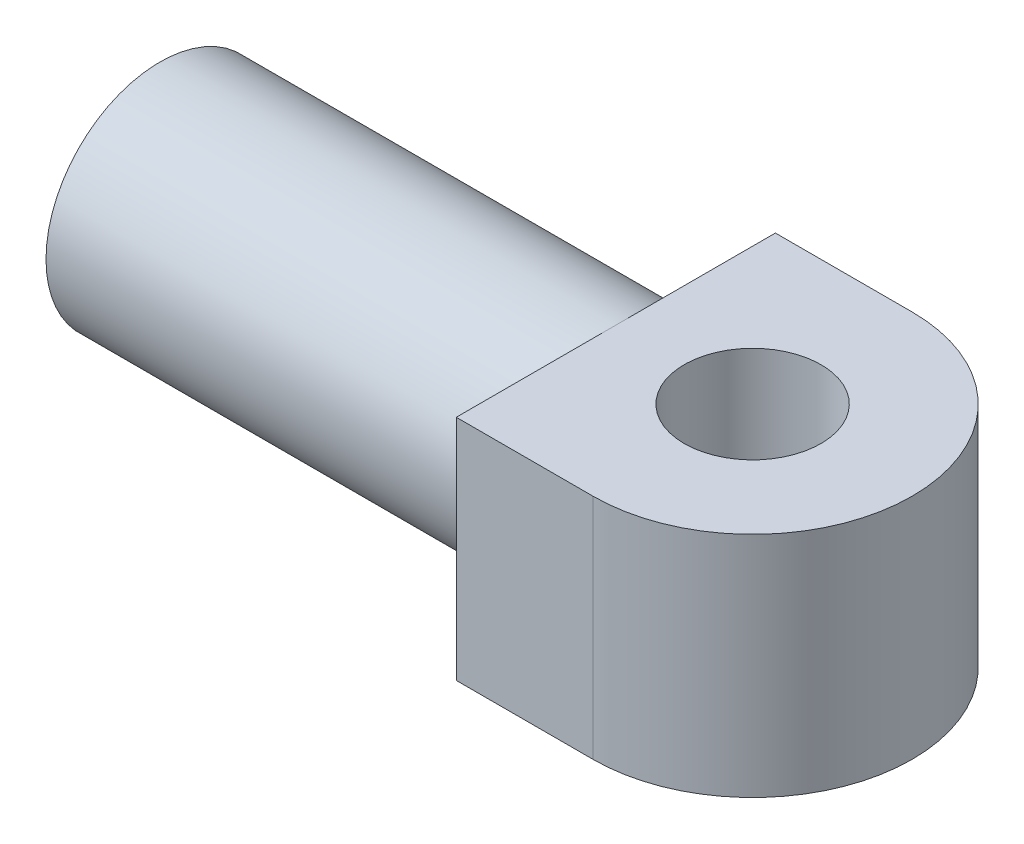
ISO-10303-21;
HEADER;
FILE_DESCRIPTION(('STEP AP214'),'2;1');
FILE_NAME('part.step','',(''),(''),'','','');
FILE_SCHEMA(('AUTOMOTIVE_DESIGN { 1 0 10303 214 1 1 1 1 }'));
ENDSEC;
DATA;
#1=APPLICATION_CONTEXT('core data for automotive mechanical design processes');
#2=APPLICATION_PROTOCOL_DEFINITION('international standard','automotive_design',2000,#1);
#3=PRODUCT_CONTEXT('',#1,'mechanical');
#4=PRODUCT('Part','Part','',(#3));
#5=PRODUCT_RELATED_PRODUCT_CATEGORY('part','',(#4));
#6=PRODUCT_DEFINITION_FORMATION('','',#4);
#7=PRODUCT_DEFINITION_CONTEXT('part definition',#1,'design');
#8=PRODUCT_DEFINITION('design','',#6,#7);
#9=PRODUCT_DEFINITION_SHAPE('','',#8);
#10=(LENGTH_UNIT() NAMED_UNIT(*) SI_UNIT(.MILLI.,.METRE.));
#11=(NAMED_UNIT(*) PLANE_ANGLE_UNIT() SI_UNIT($,.RADIAN.));
#12=(NAMED_UNIT(*) SI_UNIT($,.STERADIAN.) SOLID_ANGLE_UNIT());
#13=UNCERTAINTY_MEASURE_WITH_UNIT(LENGTH_MEASURE(1.E-05),#10,'distance_accuracy_value','');
#14=(GEOMETRIC_REPRESENTATION_CONTEXT(3) GLOBAL_UNCERTAINTY_ASSIGNED_CONTEXT((#13)) GLOBAL_UNIT_ASSIGNED_CONTEXT((#10,
#11,#12)) REPRESENTATION_CONTEXT('',''));
#15=CARTESIAN_POINT('',(0.,0.,0.));
#16=DIRECTION('',(0.,0.,1.));
#17=DIRECTION('',(1.,0.,0.));
#18=AXIS2_PLACEMENT_3D('',#15,#16,#17);
#19=CARTESIAN_POINT('',(-6.,10.,-7.));
#20=DIRECTION('',(1.,0.,0.));
#21=DIRECTION('',(0.,0.,-1.));
#22=AXIS2_PLACEMENT_3D('',#19,#20,#21);
#23=PLANE('',#22);
#24=CARTESIAN_POINT('',(-6.,5.,0.));
#25=DIRECTION('',(-1.,0.,0.));
#26=DIRECTION('',(0.,0.,1.));
#27=AXIS2_PLACEMENT_3D('',#24,#25,#26);
#28=CIRCLE('',#27,5.);
#29=CARTESIAN_POINT('',(-6.,10.,0.));
#30=VERTEX_POINT('',#29);
#31=CARTESIAN_POINT('',(-6.,0.,0.));
#32=VERTEX_POINT('',#31);
#33=EDGE_CURVE('E41',#30,#32,#28,.T.);
#34=ORIENTED_EDGE('',*,*,#33,.F.);
#35=DIRECTION('',(0.,0.,1.));
#36=VECTOR('',#35,1.);
#37=CARTESIAN_POINT('',(-6.,10.,-7.));
#38=LINE('',#37,#36);
#39=CARTESIAN_POINT('',(-6.,10.,-7.));
#40=VERTEX_POINT('',#39);
#41=EDGE_CURVE('E83',#40,#30,#38,.T.);
#42=ORIENTED_EDGE('',*,*,#41,.F.);
#43=DIRECTION('',(0.,-1.,0.));
#44=VECTOR('',#43,1.);
#45=CARTESIAN_POINT('',(-6.,10.,-7.));
#46=LINE('',#45,#44);
#47=CARTESIAN_POINT('',(-6.,0.,-7.));
#48=VERTEX_POINT('',#47);
#49=EDGE_CURVE('E39',#40,#48,#46,.T.);
#50=ORIENTED_EDGE('',*,*,#49,.T.);
#51=DIRECTION('',(0.,0.,1.));
#52=VECTOR('',#51,1.);
#53=CARTESIAN_POINT('',(-6.,0.,-7.));
#54=LINE('',#53,#52);
#55=EDGE_CURVE('E101',#48,#32,#54,.T.);
#56=ORIENTED_EDGE('',*,*,#55,.T.);
#57=EDGE_LOOP('',(#34,#42,#50,#56));
#58=FACE_BOUND('',#57,.T.);
#59=ADVANCED_FACE('F30',(#58),#23,.F.);
#60=EDGE_CURVE('E11',#32,#30,#28,.T.);
#61=ORIENTED_EDGE('',*,*,#60,.F.);
#62=CARTESIAN_POINT('',(-6.,0.,7.));
#63=VERTEX_POINT('',#62);
#64=EDGE_CURVE('E140',#32,#63,#54,.T.);
#65=ORIENTED_EDGE('',*,*,#64,.T.);
#66=DIRECTION('',(0.,-1.,0.));
#67=VECTOR('',#66,1.);
#68=CARTESIAN_POINT('',(-6.,10.,7.));
#69=LINE('',#68,#67);
#70=CARTESIAN_POINT('',(-6.,10.,7.));
#71=VERTEX_POINT('',#70);
#72=EDGE_CURVE('E97',#71,#63,#69,.T.);
#73=ORIENTED_EDGE('',*,*,#72,.F.);
#74=EDGE_CURVE('E88',#30,#71,#38,.T.);
#75=ORIENTED_EDGE('',*,*,#74,.F.);
#76=EDGE_LOOP('',(#61,#65,#73,#75));
#77=FACE_BOUND('',#76,.T.);
#78=ADVANCED_FACE('F95',(#77),#23,.F.);
#79=CARTESIAN_POINT('',(0.,10.,0.));
#80=DIRECTION('',(0.,1.,0.));
#81=DIRECTION('',(0.,0.,1.));
#82=AXIS2_PLACEMENT_3D('',#79,#80,#81);
#83=PLANE('',#82);
#84=DIRECTION('',(-1.,0.,0.));
#85=VECTOR('',#84,1.);
#86=CARTESIAN_POINT('',(-6.,10.,-7.));
#87=LINE('',#86,#85);
#88=CARTESIAN_POINT('',(0.,10.,-7.));
#89=VERTEX_POINT('',#88);
#90=EDGE_CURVE('E91',#89,#40,#87,.T.);
#91=ORIENTED_EDGE('',*,*,#90,.T.);
#92=ORIENTED_EDGE('',*,*,#41,.T.);
#93=ORIENTED_EDGE('',*,*,#74,.T.);
#94=DIRECTION('',(1.,0.,0.));
#95=VECTOR('',#94,1.);
#96=CARTESIAN_POINT('',(-6.,10.,7.));
#97=LINE('',#96,#95);
#98=CARTESIAN_POINT('',(0.,10.,7.));
#99=VERTEX_POINT('',#98);
#100=EDGE_CURVE('E93',#71,#99,#97,.T.);
#101=ORIENTED_EDGE('',*,*,#100,.T.);
#102=CARTESIAN_POINT('',(0.,10.,0.));
#103=DIRECTION('',(0.,1.,0.));
#104=DIRECTION('',(0.,0.,1.));
#105=AXIS2_PLACEMENT_3D('',#102,#103,#104);
#106=CIRCLE('',#105,7.);
#107=EDGE_CURVE('E55',#99,#89,#106,.T.);
#108=ORIENTED_EDGE('',*,*,#107,.T.);
#109=EDGE_LOOP('',(#91,#92,#93,#101,#108));
#110=FACE_BOUND('',#109,.T.);
#111=CARTESIAN_POINT('',(0.,10.,0.));
#112=DIRECTION('',(0.,1.,0.));
#113=DIRECTION('',(0.,0.,1.));
#114=AXIS2_PLACEMENT_3D('',#111,#112,#113);
#115=CIRCLE('',#114,3.);
#116=CARTESIAN_POINT('',(0.,10.,3.));
#117=VERTEX_POINT('',#116);
#118=EDGE_CURVE('E141',#117,#117,#115,.T.);
#119=ORIENTED_EDGE('',*,*,#118,.F.);
#120=EDGE_LOOP('',(#119));
#121=FACE_BOUND('',#120,.T.);
#122=ADVANCED_FACE('F86',(#110,#121),#83,.T.);
#123=CARTESIAN_POINT('',(0.,0.,0.));
#124=DIRECTION('',(0.,1.,0.));
#125=DIRECTION('',(0.,0.,1.));
#126=AXIS2_PLACEMENT_3D('',#123,#124,#125);
#127=PLANE('',#126);
#128=DIRECTION('',(-1.,0.,0.));
#129=VECTOR('',#128,1.);
#130=CARTESIAN_POINT('',(-6.,0.,-7.));
#131=LINE('',#130,#129);
#132=CARTESIAN_POINT('',(0.,0.,-7.));
#133=VERTEX_POINT('',#132);
#134=EDGE_CURVE('E138',#133,#48,#131,.T.);
#135=ORIENTED_EDGE('',*,*,#134,.F.);
#136=CARTESIAN_POINT('',(0.,0.,0.));
#137=DIRECTION('',(0.,1.,0.));
#138=DIRECTION('',(0.,0.,1.));
#139=AXIS2_PLACEMENT_3D('',#136,#137,#138);
#140=CIRCLE('',#139,7.);
#141=CARTESIAN_POINT('',(0.,0.,7.));
#142=VERTEX_POINT('',#141);
#143=EDGE_CURVE('E75',#142,#133,#140,.T.);
#144=ORIENTED_EDGE('',*,*,#143,.F.);
#145=DIRECTION('',(1.,0.,0.));
#146=VECTOR('',#145,1.);
#147=CARTESIAN_POINT('',(-6.,0.,7.));
#148=LINE('',#147,#146);
#149=EDGE_CURVE('E150',#63,#142,#148,.T.);
#150=ORIENTED_EDGE('',*,*,#149,.F.);
#151=ORIENTED_EDGE('',*,*,#64,.F.);
#152=ORIENTED_EDGE('',*,*,#55,.F.);
#153=EDGE_LOOP('',(#135,#144,#150,#151,#152));
#154=FACE_BOUND('',#153,.T.);
#155=CARTESIAN_POINT('',(0.,0.,0.));
#156=DIRECTION('',(0.,1.,0.));
#157=DIRECTION('',(0.,0.,1.));
#158=AXIS2_PLACEMENT_3D('',#155,#156,#157);
#159=CIRCLE('',#158,3.);
#160=CARTESIAN_POINT('',(0.,0.,3.));
#161=VERTEX_POINT('',#160);
#162=EDGE_CURVE('E145',#161,#161,#159,.T.);
#163=ORIENTED_EDGE('',*,*,#162,.T.);
#164=EDGE_LOOP('',(#163));
#165=FACE_BOUND('',#164,.T.);
#166=ADVANCED_FACE('F127',(#154,#165),#127,.F.);
#167=CARTESIAN_POINT('',(-6.,10.,-7.));
#168=DIRECTION('',(0.,0.,1.));
#169=DIRECTION('',(1.,0.,0.));
#170=AXIS2_PLACEMENT_3D('',#167,#168,#169);
#171=PLANE('',#170);
#172=ORIENTED_EDGE('',*,*,#134,.T.);
#173=ORIENTED_EDGE('',*,*,#49,.F.);
#174=ORIENTED_EDGE('',*,*,#90,.F.);
#175=DIRECTION('',(0.,-1.,0.));
#176=VECTOR('',#175,1.);
#177=CARTESIAN_POINT('',(0.,10.,-7.));
#178=LINE('',#177,#176);
#179=EDGE_CURVE('E139',#89,#133,#178,.T.);
#180=ORIENTED_EDGE('',*,*,#179,.T.);
#181=EDGE_LOOP('',(#172,#173,#174,#180));
#182=FACE_BOUND('',#181,.T.);
#183=ADVANCED_FACE('F125',(#182),#171,.F.);
#184=CARTESIAN_POINT('',(-6.,10.,7.));
#185=DIRECTION('',(0.,0.,-1.));
#186=DIRECTION('',(-1.,0.,0.));
#187=AXIS2_PLACEMENT_3D('',#184,#185,#186);
#188=PLANE('',#187);
#189=ORIENTED_EDGE('',*,*,#149,.T.);
#190=DIRECTION('',(0.,-1.,0.));
#191=VECTOR('',#190,1.);
#192=CARTESIAN_POINT('',(0.,10.,7.));
#193=LINE('',#192,#191);
#194=EDGE_CURVE('E154',#99,#142,#193,.T.);
#195=ORIENTED_EDGE('',*,*,#194,.F.);
#196=ORIENTED_EDGE('',*,*,#100,.F.);
#197=ORIENTED_EDGE('',*,*,#72,.T.);
#198=EDGE_LOOP('',(#189,#195,#196,#197));
#199=FACE_BOUND('',#198,.T.);
#200=ADVANCED_FACE('F123',(#199),#188,.F.);
#201=CARTESIAN_POINT('',(0.,10.,0.));
#202=DIRECTION('',(0.,-1.,0.));
#203=DIRECTION('',(0.,0.,-1.));
#204=AXIS2_PLACEMENT_3D('',#201,#202,#203);
#205=CYLINDRICAL_SURFACE('',#204,7.);
#206=ORIENTED_EDGE('',*,*,#143,.T.);
#207=ORIENTED_EDGE('',*,*,#179,.F.);
#208=ORIENTED_EDGE('',*,*,#107,.F.);
#209=ORIENTED_EDGE('',*,*,#194,.T.);
#210=EDGE_LOOP('',(#206,#207,#208,#209));
#211=FACE_BOUND('',#210,.T.);
#212=ADVANCED_FACE('F113',(#211),#205,.T.);
#213=CARTESIAN_POINT('',(0.,10.,0.));
#214=DIRECTION('',(0.,-1.,0.));
#215=DIRECTION('',(0.,0.,-1.));
#216=AXIS2_PLACEMENT_3D('',#213,#214,#215);
#217=CYLINDRICAL_SURFACE('',#216,3.);
#218=ORIENTED_EDGE('',*,*,#118,.T.);
#219=EDGE_LOOP('',(#218));
#220=FACE_BOUND('',#219,.T.);
#221=ORIENTED_EDGE('',*,*,#162,.F.);
#222=EDGE_LOOP('',(#221));
#223=FACE_BOUND('',#222,.T.);
#224=ADVANCED_FACE('F105',(#220,#223),#217,.F.);
#225=CARTESIAN_POINT('',(-26.,5.,0.));
#226=DIRECTION('',(1.,0.,0.));
#227=DIRECTION('',(0.,0.,-1.));
#228=AXIS2_PLACEMENT_3D('',#225,#226,#227);
#229=CYLINDRICAL_SURFACE('',#228,5.);
#230=CARTESIAN_POINT('',(-26.,5.,0.));
#231=DIRECTION('',(-1.,0.,0.));
#232=DIRECTION('',(0.,0.,1.));
#233=AXIS2_PLACEMENT_3D('',#230,#231,#232);
#234=CIRCLE('',#233,5.);
#235=CARTESIAN_POINT('',(-26.,5.,5.));
#236=VERTEX_POINT('',#235);
#237=EDGE_CURVE('E34',#236,#236,#234,.T.);
#238=ORIENTED_EDGE('',*,*,#237,.F.);
#239=EDGE_LOOP('',(#238));
#240=FACE_BOUND('',#239,.T.);
#241=ORIENTED_EDGE('',*,*,#33,.T.);
#242=ORIENTED_EDGE('',*,*,#60,.T.);
#243=EDGE_LOOP('',(#241,#242));
#244=FACE_BOUND('',#243,.T.);
#245=ADVANCED_FACE('F103',(#240,#244),#229,.T.);
#246=CARTESIAN_POINT('',(-16.1833333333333,5.,0.));
#247=DIRECTION('',(0.,0.,1.));
#248=DIRECTION('',(1.,0.,0.));
#249=AXIS2_PLACEMENT_3D('',#246,#247,#248);
#250=SPHERICAL_SURFACE('',#249,11.0166666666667);
#251=CARTESIAN_POINT('',(-16.1833333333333,5.,0.));
#252=DIRECTION('',(-1.,0.,0.));
#253=DIRECTION('',(0.,0.,1.));
#254=AXIS2_PLACEMENT_3D('',#251,#252,#253);
#255=SPHERICAL_SURFACE('',#254,11.0166666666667);
#256=ORIENTED_EDGE('',*,*,#237,.T.);
#257=EDGE_LOOP('',(#256));
#258=FACE_BOUND('',#257,.T.);
#259=ADVANCED_FACE('F32',(#258),#255,.T.);
#260=CLOSED_SHELL('',(#59,#78,#122,#166,#183,#200,#212,#224,#245,#259));
#261=MANIFOLD_SOLID_BREP('B2',#260);
#262=ADVANCED_BREP_SHAPE_REPRESENTATION('',(#18,#261),#14);
#263=SHAPE_DEFINITION_REPRESENTATION(#9,#262);
ENDSEC;
END-ISO-10303-21;
